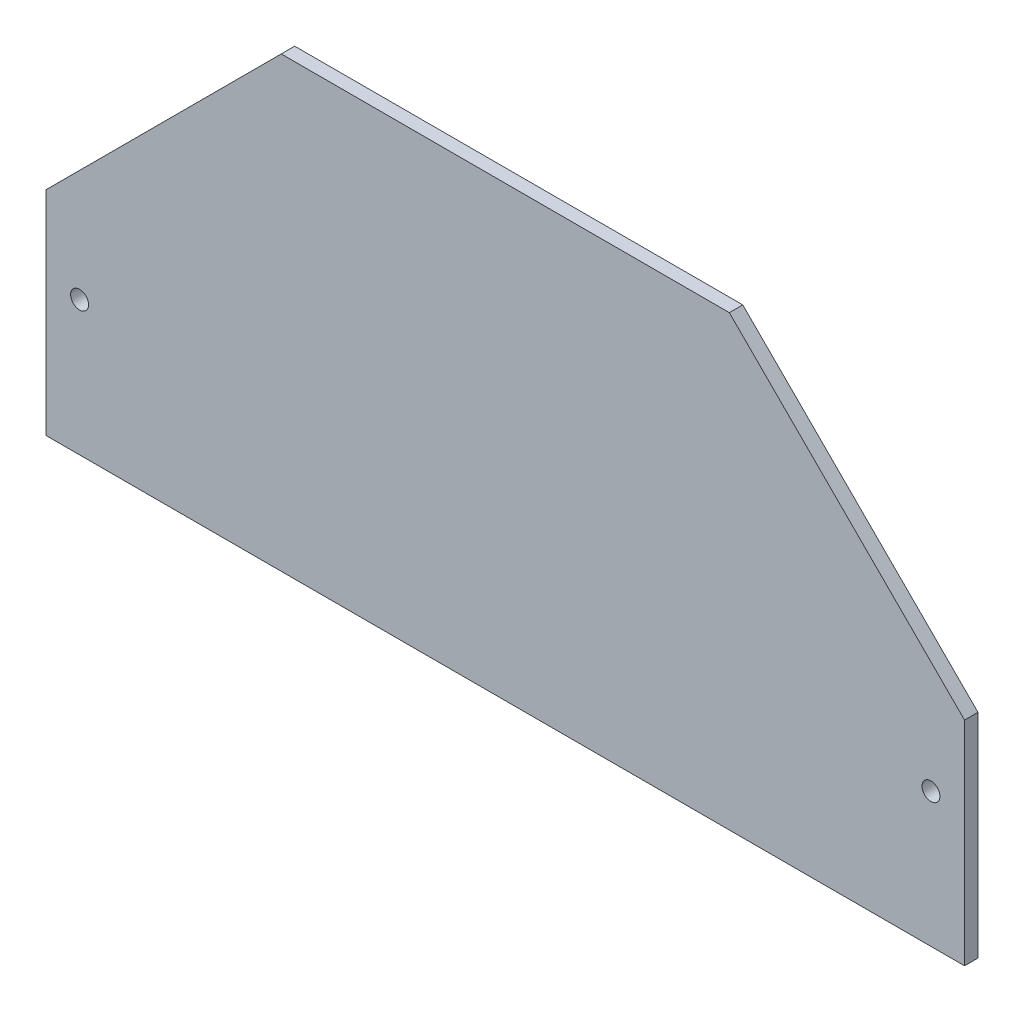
from build123d import *

# Parameters (mm, degrees)
SKETCH1_W           = 1025
SKETCH1_H           = 500
SKETCH1_R           = 10
BOSS_EXTRUDE1_DEPTH = 15
SKETCH2_OUTSIDE_W   = 1255.11
SKETCH2_OUTSIDE_H   = 730.11
CUT_EXTRUDE1_DEPTH  = 571.421992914


with BuildPart() as part:
    # Sketch1 → Boss-Extrude1 (new body)
    with BuildSketch(Plane.XY):
        Rectangle(SKETCH1_W, SKETCH1_H)
        with Locations((-475, -100)):
            Circle(SKETCH1_R, mode=Mode.SUBTRACT)
        with Locations((475, -100)):
            Circle(SKETCH1_R, mode=Mode.SUBTRACT)
    extrude(amount=BOSS_EXTRUDE1_DEPTH)

    # Sketch2 outside → Cut-Extrude1 (cut, through all)
    with BuildSketch(Plane.XY):
        Rectangle(SKETCH2_OUTSIDE_W, SKETCH2_OUTSIDE_H)
        Polygon((-512.5, -250), (-512.5, -12.5), (-250, 250), (250, 250), (512.5, -12.5), (512.5, -250), align=None, mode=Mode.SUBTRACT)
    extrude(amount=CUT_EXTRUDE1_DEPTH, mode=Mode.SUBTRACT)


solid = part.part
